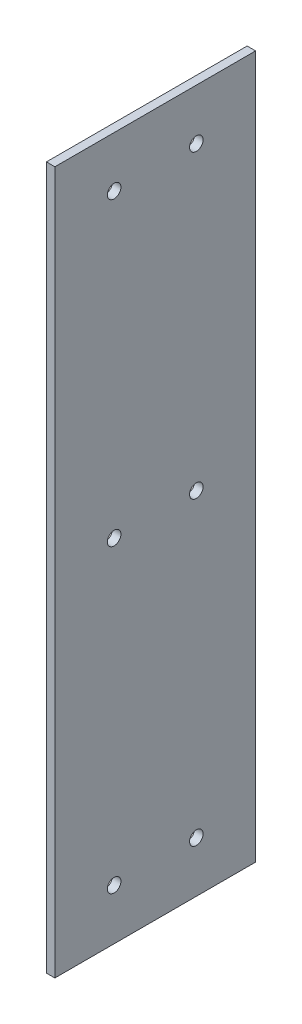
from build123d import *

# Parameters (mm, degrees)
ESQUISSE22_W       = 237.097978
ESQUISSE22_H       = 829.819983
ESQUISSE22_R       = 8
BOSS_EXTRU_1_DEPTH = 10


with BuildPart() as part:
    # Esquisse22 → Boss.-Extru.1 (new body)
    with BuildSketch(Plane(origin=(0, 0, 0), x_dir=(0, 0, -1), z_dir=(1, 0, 0))):
        with Locations((-2826.448083, -415.0899915)):
            Rectangle(ESQUISSE22_W, ESQUISSE22_H)
        with Locations((-2875, -769.999981)):
            Circle(ESQUISSE22_R, mode=Mode.SUBTRACT)
        with Locations((-2777.899981, -769.999981)):
            Circle(ESQUISSE22_R, mode=Mode.SUBTRACT)
        with Locations((-2777.899981, -414.999992)):
            Circle(ESQUISSE22_R, mode=Mode.SUBTRACT)
        with Locations((-2875, -414.999992)):
            Circle(ESQUISSE22_R, mode=Mode.SUBTRACT)
        with Locations((-2875, -59.999999)):
            Circle(ESQUISSE22_R, mode=Mode.SUBTRACT)
        with Locations((-2777.899981, -59.999999)):
            Circle(ESQUISSE22_R, mode=Mode.SUBTRACT)
    extrude(amount=BOSS_EXTRU_1_DEPTH)


solid = part.part
